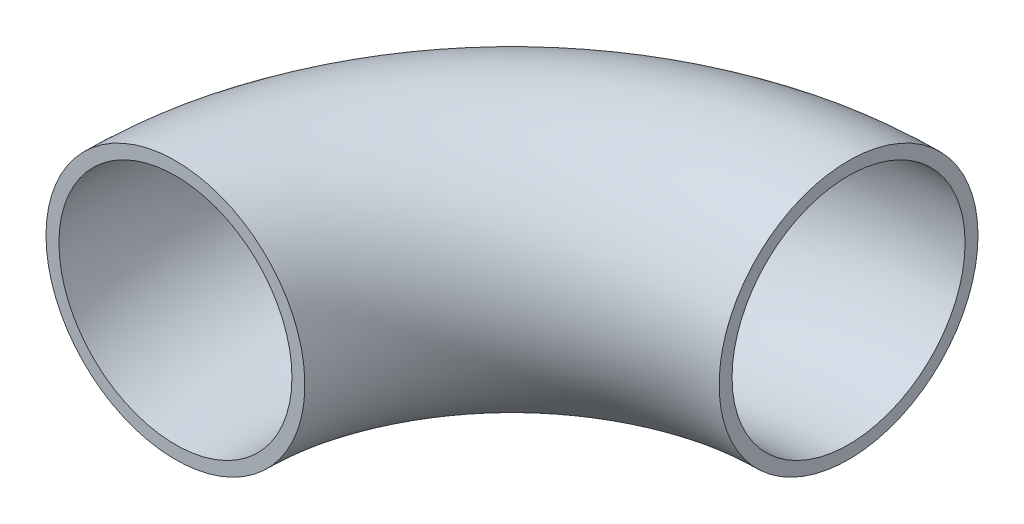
from build123d import *

# Parameters (mm, degrees)
ESQUISSE1_R   = 15
ESQUISSE1_R_2 = 13.5


with BuildPart() as part:
    # Balayage-Mince2: sweep along a path in Esquisse2
    with BuildLine(Plane(origin=(0, 0, 0), x_dir=(1, 0, 0), z_dir=(0, 1, 0))) as balayage_mince2_path:
        ThreePointArc((0, 0), (11.422835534, 27.577164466), (39, 39))
    # Esquisse1 → Balayage-Mince2 (sweep)
    with BuildSketch(Plane.XY):
        Circle(ESQUISSE1_R)
        Circle(ESQUISSE1_R_2, mode=Mode.SUBTRACT)
    sweep(path=balayage_mince2_path.line)


solid = part.part
